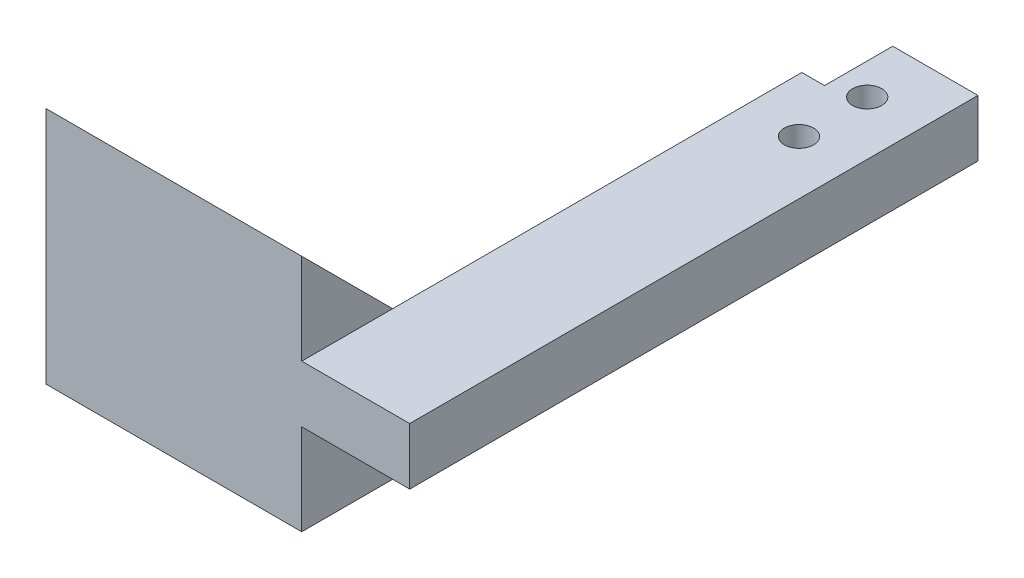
from build123d import *

# Parameters (mm, degrees)
SKETCH1_W                    = 12.065
SKETCH1_H                    = 63.5
BOSS_EXTRUDE1_DEPTH          = 6.35
SKETCH5_W                    = 2.54
SKETCH5_H                    = 7.62
CUT_EXTRUDE1_DEPTH           = 33.935938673
BOSS_EXTRUDE3_DEPTH          = 28.575
F_30_0_1285_DIAMETER_HOLE1_D = 3.2639


with BuildPart() as part:
    # Sketch1 → Boss-Extrude1 (new body)
    with BuildSketch(Plane(origin=(0, 0, 0), x_dir=(1, 0, 0), z_dir=(0, 1, 0))):
        Rectangle(SKETCH1_W, SKETCH1_H)
    extrude(amount=BOSS_EXTRUDE1_DEPTH)

    # Sketch5 → Cut-Extrude1 (cut, through all)
    with BuildSketch(Plane(origin=(0, 6.35, 0), x_dir=(1, 0, 0), z_dir=(0, 1, 0))):
        with Locations((-4.7625, 27.94)):
            Rectangle(SKETCH5_W, SKETCH5_H)
    extrude(amount=-CUT_EXTRUDE1_DEPTH, mode=Mode.SUBTRACT)

    # Sketch6 → Boss-Extrude3 (add)
    with BuildSketch(Plane.ZY.offset(6.0325)):
        Polygon((31.75, 0), (31.75, 6.35), (31.75, 16.51), (5.08, -10.16), (31.75, -10.16), align=None)
    extrude(amount=BOSS_EXTRUDE3_DEPTH)

    # 30 _0.1285_ Diameter Hole1 (through all)
    with Locations(Plane(origin=(0, 6.35, 0), x_dir=(1, 0, 0), z_dir=(0, 1, 0))):
        with Locations((0, 25.4), (0, 17.78)):
            Hole(F_30_0_1285_DIAMETER_HOLE1_D / 2)


solid = part.part
